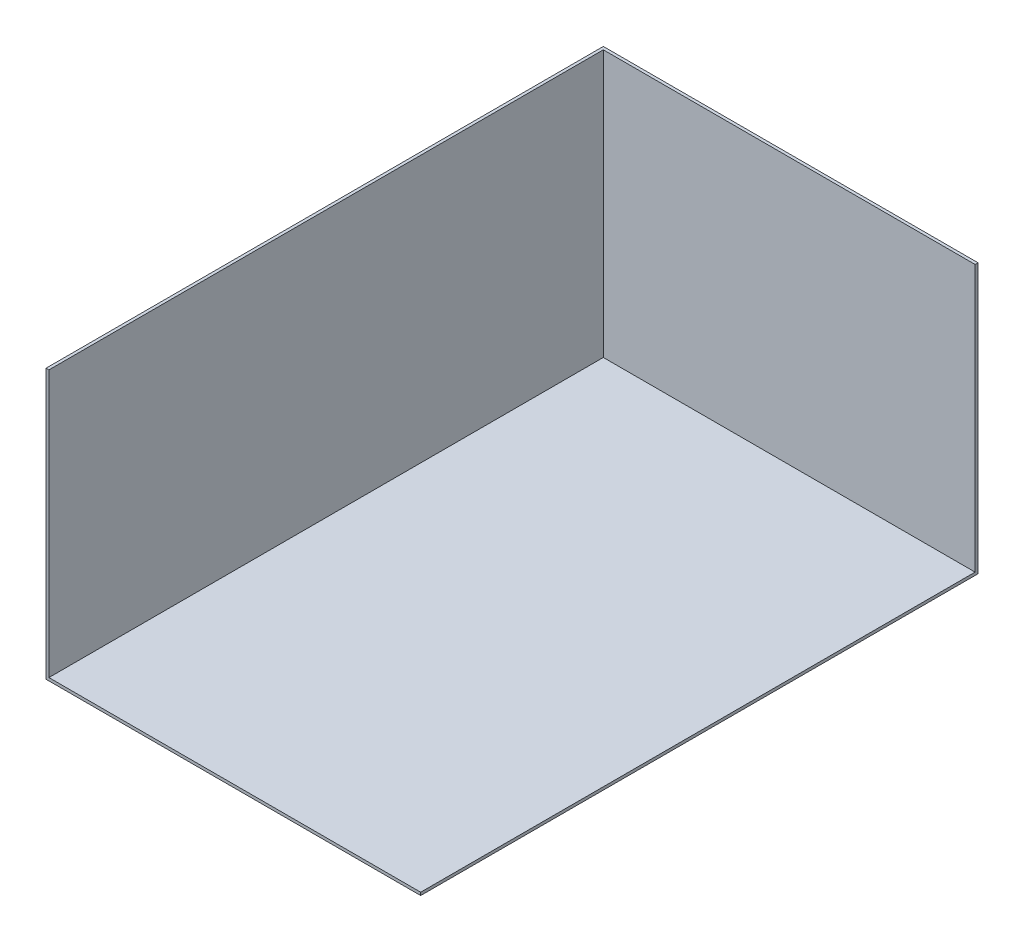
from build123d import *

# Parameters (mm, degrees)
SKIZZE1_W               = 128.877391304
SKIZZE1_H               = 92.654782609
LINEAR_AUSTRAGEN1_DEPTH = 191.7
WANDUNG1_T              = -1


with BuildPart() as part:
    # Skizze1 → Linear austragen1 (new body)
    with BuildSketch(Plane.XY):
        with Locations((64.438695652, 46.327391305)):
            Rectangle(SKIZZE1_W, SKIZZE1_H)
    extrude(amount=LINEAR_AUSTRAGEN1_DEPTH)

    # Wandung1
    wandung1_openings = [part.faces().sort_by_distance(p)[0] for p in [
        (64.438695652, 46.327391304, 191.7),
        (64.438695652, 92.654782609, 95.85),
        (128.877391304, 46.327391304, 95.85),
    ]]
    offset(amount=WANDUNG1_T, openings=wandung1_openings, kind=Kind.INTERSECTION)


solid = part.part
